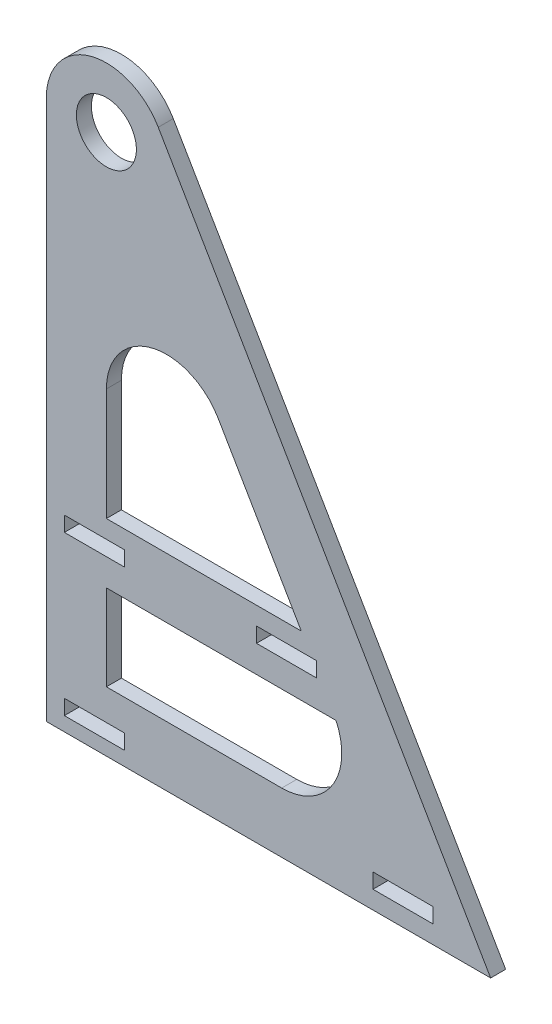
from build123d import *

# Parameters (mm, degrees)
SKETCH1_R           = 25
BOSS_EXTRUDE1_DEPTH = 12.5
SKETCH3_W           = 50
SKETCH3_H           = 12.5
CUT_EXTRUDE2_DEPTH  = 12.5
SKETCH4_W           = 50
SKETCH4_H           = 12.5
CUT_EXTRUDE3_DEPTH  = 12.5
SKETCH6_W           = 50
SKETCH6_H           = 12.5
CUT_EXTRUDE4_DEPTH  = 12.5


with BuildPart() as part:
    # Sketch1 → Boss-Extrude1 (new body)
    with BuildSketch(Plane.XY):
        with BuildLine():
            Line((320, -50), (43.204179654, 425.167416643))
            ThreePointArc((43.204179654, 425.167416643), (-13.034397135, 448.271155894), (-50, 400))
            Line((-50, 400), (-50, -50))
            Line((-50, -50), (320, -50))
        make_face()
        with BuildLine():
            Line((146.018183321, 0), (0, 0))
            Line((0, 0), (0, 71.369897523))
            Line((0, 71.369897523), (191.221363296, 71.369897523))
            ThreePointArc((191.221363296, 71.369897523), (188.258536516, 23.246447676), (146.018183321, 0))
        make_face(mode=Mode.SUBTRACT)
        with BuildLine():
            ThreePointArc((0, 214.831651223), (36.965602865, 263.102807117), (93.204179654, 239.999067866))
            Line((93.204179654, 239.999067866), (162.308367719, 121.369897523))
            Line((162.308367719, 121.369897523), (0, 121.369897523))
            Line((0, 121.369897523), (0, 214.831651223))
        make_face(mode=Mode.SUBTRACT)
        with Locations((0, 400)):
            Circle(SKETCH1_R, mode=Mode.SUBTRACT)
    extrude(amount=BOSS_EXTRUDE1_DEPTH)

    # Sketch3 → Cut-Extrude2 (cut)
    with BuildSketch(Plane.XY.offset(12.5)):
        with Locations((150, 100.119897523)):
            Rectangle(SKETCH3_W, SKETCH3_H)
        with Locations((-10, 100.119897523)):
            Rectangle(SKETCH3_W, SKETCH3_H)
    extrude(amount=-CUT_EXTRUDE2_DEPTH, mode=Mode.SUBTRACT)

    # Sketch4 → Cut-Extrude3 (cut)
    with BuildSketch(Plane(origin=(0, 0, 0), x_dir=(-1, 0, 0), z_dir=(0, 0, -1))):
        with Locations((-247, -28.75)):
            Rectangle(SKETCH4_W, SKETCH4_H)
    extrude(amount=-CUT_EXTRUDE3_DEPTH, mode=Mode.SUBTRACT)

    # Sketch6 → Cut-Extrude4 (cut)
    with BuildSketch(Plane(origin=(0, 0, 0), x_dir=(-1, 0, 0), z_dir=(0, 0, -1))):
        with Locations((10, -32.023740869)):
            Rectangle(SKETCH6_W, SKETCH6_H)
    extrude(amount=-CUT_EXTRUDE4_DEPTH, mode=Mode.SUBTRACT)


solid = part.part
